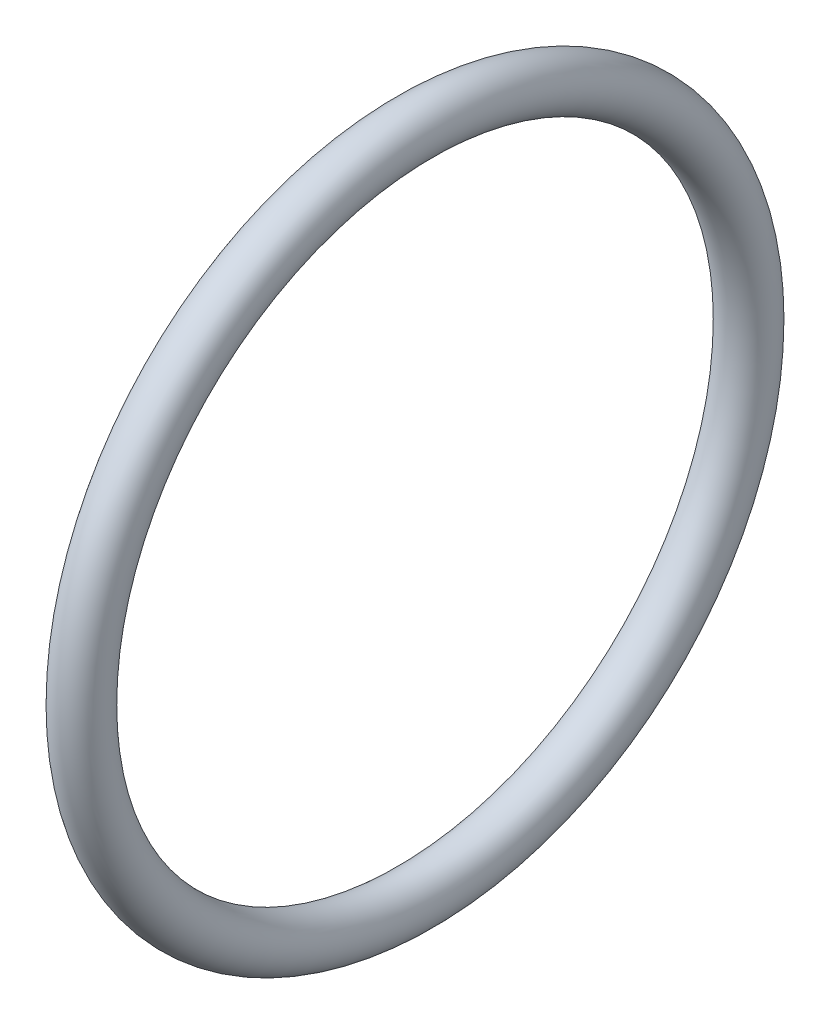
from build123d import *

# Parameters (mm, degrees)
SKETCH1_R = 0.889


with BuildPart() as part:
    # Sketch1 → Base-Revolve (revolve)
    with BuildSketch(Plane.XY, mode=Mode.PRIVATE) as base_revolve_sk:
        with Locations((0, 11.8618)):
            Circle(SKETCH1_R)
    revolve(base_revolve_sk.sketch.rotate(Axis((0, 0, 0), (1, 0, 0)), 90), axis=Axis((0, 0, 0), (1, 0, 0)))


solid = part.part
